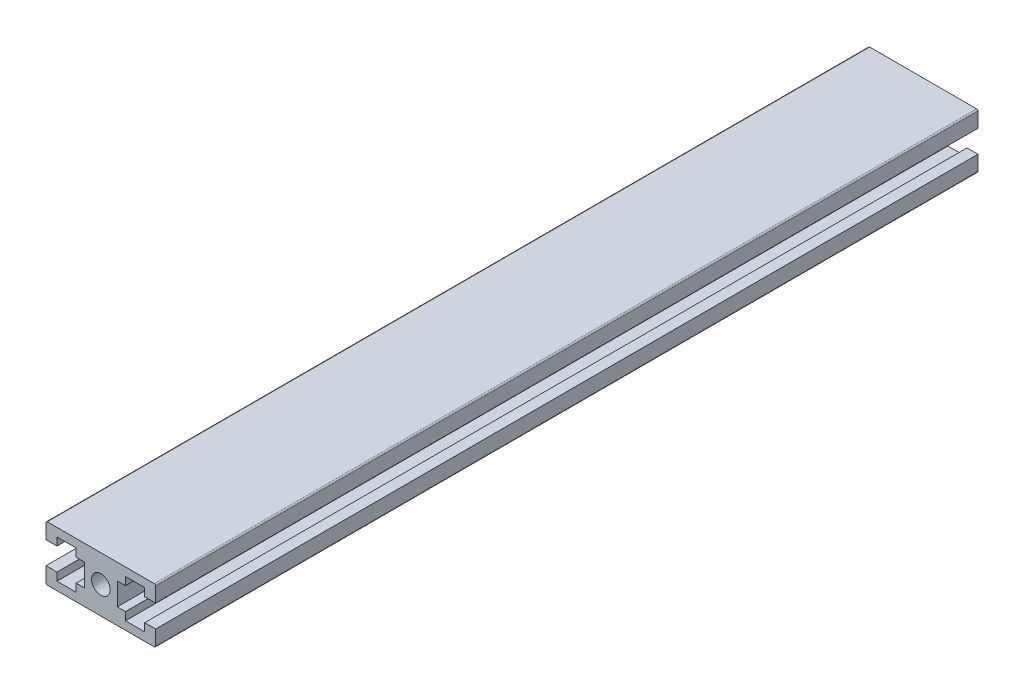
ISO-10303-21;
HEADER;
FILE_DESCRIPTION(('STEP AP214'),'2;1');
FILE_NAME('part.step','',(''),(''),'','','');
FILE_SCHEMA(('AUTOMOTIVE_DESIGN { 1 0 10303 214 1 1 1 1 }'));
ENDSEC;
DATA;
#1=APPLICATION_CONTEXT('core data for automotive mechanical design processes');
#2=APPLICATION_PROTOCOL_DEFINITION('international standard','automotive_design',2000,#1);
#3=PRODUCT_CONTEXT('',#1,'mechanical');
#4=PRODUCT('Part','Part','',(#3));
#5=PRODUCT_RELATED_PRODUCT_CATEGORY('part','',(#4));
#6=PRODUCT_DEFINITION_FORMATION('','',#4);
#7=PRODUCT_DEFINITION_CONTEXT('part definition',#1,'design');
#8=PRODUCT_DEFINITION('design','',#6,#7);
#9=PRODUCT_DEFINITION_SHAPE('','',#8);
#10=(LENGTH_UNIT() NAMED_UNIT(*) SI_UNIT(.MILLI.,.METRE.));
#11=(NAMED_UNIT(*) PLANE_ANGLE_UNIT() SI_UNIT($,.RADIAN.));
#12=(NAMED_UNIT(*) SI_UNIT($,.STERADIAN.) SOLID_ANGLE_UNIT());
#13=UNCERTAINTY_MEASURE_WITH_UNIT(LENGTH_MEASURE(1.E-05),#10,'distance_accuracy_value','');
#14=(GEOMETRIC_REPRESENTATION_CONTEXT(3) GLOBAL_UNCERTAINTY_ASSIGNED_CONTEXT((#13)) GLOBAL_UNIT_ASSIGNED_CONTEXT((#10,
#11,#12)) REPRESENTATION_CONTEXT('',''));
#15=CARTESIAN_POINT('',(0.,0.,0.));
#16=DIRECTION('',(0.,0.,1.));
#17=DIRECTION('',(1.,0.,0.));
#18=AXIS2_PLACEMENT_3D('',#15,#16,#17);
#19=CARTESIAN_POINT('',(19.5,9.50000000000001,150.));
#20=DIRECTION('',(0.,0.,1.));
#21=DIRECTION('',(1.,0.,0.));
#22=AXIS2_PLACEMENT_3D('',#19,#20,#21);
#23=PLANE('',#22);
#24=DIRECTION('',(-1.,0.,0.));
#25=VECTOR('',#24,1.);
#26=CARTESIAN_POINT('',(16.,-6.99999999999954,150.));
#27=LINE('',#26,#25);
#28=CARTESIAN_POINT('',(16.,-6.99999999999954,150.));
#29=VERTEX_POINT('',#28);
#30=CARTESIAN_POINT('',(9.,-6.99999999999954,150.));
#31=VERTEX_POINT('',#30);
#32=EDGE_CURVE('E381',#29,#31,#27,.T.);
#33=ORIENTED_EDGE('',*,*,#32,.T.);
#34=DIRECTION('',(0.,1.,0.));
#35=VECTOR('',#34,1.);
#36=CARTESIAN_POINT('',(9.,-6.99999999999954,150.));
#37=LINE('',#36,#35);
#38=CARTESIAN_POINT('',(9.,-4.09999999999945,150.));
#39=VERTEX_POINT('',#38);
#40=EDGE_CURVE('E172',#31,#39,#37,.T.);
#41=ORIENTED_EDGE('',*,*,#40,.T.);
#42=DIRECTION('',(-1.,0.,0.));
#43=VECTOR('',#42,1.);
#44=CARTESIAN_POINT('',(9.,-4.09999999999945,150.));
#45=LINE('',#44,#43);
#46=CARTESIAN_POINT('',(6.,-4.09999999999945,150.));
#47=VERTEX_POINT('',#46);
#48=EDGE_CURVE('E498',#39,#47,#45,.T.);
#49=ORIENTED_EDGE('',*,*,#48,.T.);
#50=DIRECTION('',(0.,1.,0.));
#51=VECTOR('',#50,1.);
#52=CARTESIAN_POINT('',(6.,-4.09999999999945,150.));
#53=LINE('',#52,#51);
#54=CARTESIAN_POINT('',(6.,4.10000000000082,150.));
#55=VERTEX_POINT('',#54);
#56=EDGE_CURVE('E518',#47,#55,#53,.T.);
#57=ORIENTED_EDGE('',*,*,#56,.T.);
#58=DIRECTION('',(1.,0.,0.));
#59=VECTOR('',#58,1.);
#60=CARTESIAN_POINT('',(6.,4.10000000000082,150.));
#61=LINE('',#60,#59);
#62=CARTESIAN_POINT('',(9.,4.10000000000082,150.));
#63=VERTEX_POINT('',#62);
#64=EDGE_CURVE('E514',#55,#63,#61,.T.);
#65=ORIENTED_EDGE('',*,*,#64,.T.);
#66=DIRECTION('',(0.,1.,0.));
#67=VECTOR('',#66,1.);
#68=CARTESIAN_POINT('',(9.,4.10000000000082,150.));
#69=LINE('',#68,#67);
#70=CARTESIAN_POINT('',(9.,7.00000000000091,150.));
#71=VERTEX_POINT('',#70);
#72=EDGE_CURVE('E517',#63,#71,#69,.T.);
#73=ORIENTED_EDGE('',*,*,#72,.T.);
#74=DIRECTION('',(1.,0.,0.));
#75=VECTOR('',#74,1.);
#76=CARTESIAN_POINT('',(9.,7.00000000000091,150.));
#77=LINE('',#76,#75);
#78=CARTESIAN_POINT('',(16.,7.00000000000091,150.));
#79=VERTEX_POINT('',#78);
#80=EDGE_CURVE('E522',#71,#79,#77,.T.);
#81=ORIENTED_EDGE('',*,*,#80,.T.);
#82=DIRECTION('',(0.,-1.,0.));
#83=VECTOR('',#82,1.);
#84=CARTESIAN_POINT('',(16.,7.00000000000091,150.));
#85=LINE('',#84,#83);
#86=CARTESIAN_POINT('',(16.,4.10000000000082,150.));
#87=VERTEX_POINT('',#86);
#88=EDGE_CURVE('E530',#79,#87,#85,.T.);
#89=ORIENTED_EDGE('',*,*,#88,.T.);
#90=DIRECTION('',(1.,0.,0.));
#91=VECTOR('',#90,1.);
#92=CARTESIAN_POINT('',(16.,4.10000000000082,150.));
#93=LINE('',#92,#91);
#94=CARTESIAN_POINT('',(20.,4.10000000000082,150.));
#95=VERTEX_POINT('',#94);
#96=EDGE_CURVE('E533',#87,#95,#93,.T.);
#97=ORIENTED_EDGE('',*,*,#96,.T.);
#98=DIRECTION('',(0.,1.,0.));
#99=VECTOR('',#98,1.);
#100=CARTESIAN_POINT('',(20.,4.10000000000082,150.));
#101=LINE('',#100,#99);
#102=CARTESIAN_POINT('',(20.,9.5,150.));
#103=VERTEX_POINT('',#102);
#104=EDGE_CURVE('E536',#95,#103,#101,.T.);
#105=ORIENTED_EDGE('',*,*,#104,.T.);
#106=CARTESIAN_POINT('',(19.5,9.50000000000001,150.));
#107=DIRECTION('',(0.,0.,1.));
#108=DIRECTION('',(1.,0.,0.));
#109=AXIS2_PLACEMENT_3D('',#106,#107,#108);
#110=CIRCLE('',#109,0.499999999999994);
#111=CARTESIAN_POINT('',(19.5,10.,150.));
#112=VERTEX_POINT('',#111);
#113=EDGE_CURVE('E539',#103,#112,#110,.T.);
#114=ORIENTED_EDGE('',*,*,#113,.T.);
#115=DIRECTION('',(-1.,0.,0.));
#116=VECTOR('',#115,1.);
#117=CARTESIAN_POINT('',(19.5,10.,150.));
#118=LINE('',#117,#116);
#119=CARTESIAN_POINT('',(-19.5,10.,150.));
#120=VERTEX_POINT('',#119);
#121=EDGE_CURVE('E542',#112,#120,#118,.T.);
#122=ORIENTED_EDGE('',*,*,#121,.T.);
#123=CARTESIAN_POINT('',(-19.5,9.5,150.));
#124=DIRECTION('',(0.,0.,1.));
#125=DIRECTION('',(1.,0.,0.));
#126=AXIS2_PLACEMENT_3D('',#123,#124,#125);
#127=CIRCLE('',#126,0.5);
#128=CARTESIAN_POINT('',(-20.,9.5,150.));
#129=VERTEX_POINT('',#128);
#130=EDGE_CURVE('E545',#120,#129,#127,.T.);
#131=ORIENTED_EDGE('',*,*,#130,.T.);
#132=DIRECTION('',(0.,-1.,0.));
#133=VECTOR('',#132,1.);
#134=CARTESIAN_POINT('',(-20.,9.5,150.));
#135=LINE('',#134,#133);
#136=CARTESIAN_POINT('',(-20.,4.09999999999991,150.));
#137=VERTEX_POINT('',#136);
#138=EDGE_CURVE('E548',#129,#137,#135,.T.);
#139=ORIENTED_EDGE('',*,*,#138,.T.);
#140=DIRECTION('',(1.,0.,0.));
#141=VECTOR('',#140,1.);
#142=CARTESIAN_POINT('',(-20.,4.09999999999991,150.));
#143=LINE('',#142,#141);
#144=CARTESIAN_POINT('',(-16.,4.09999999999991,150.));
#145=VERTEX_POINT('',#144);
#146=EDGE_CURVE('E551',#137,#145,#143,.T.);
#147=ORIENTED_EDGE('',*,*,#146,.T.);
#148=DIRECTION('',(0.,1.,0.));
#149=VECTOR('',#148,1.);
#150=CARTESIAN_POINT('',(-16.,4.09999999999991,150.));
#151=LINE('',#150,#149);
#152=CARTESIAN_POINT('',(-16.,7.,150.));
#153=VERTEX_POINT('',#152);
#154=EDGE_CURVE('E554',#145,#153,#151,.T.);
#155=ORIENTED_EDGE('',*,*,#154,.T.);
#156=DIRECTION('',(1.,0.,0.));
#157=VECTOR('',#156,1.);
#158=CARTESIAN_POINT('',(-16.,7.,150.));
#159=LINE('',#158,#157);
#160=CARTESIAN_POINT('',(-9.,7.,150.));
#161=VERTEX_POINT('',#160);
#162=EDGE_CURVE('E556',#153,#161,#159,.T.);
#163=ORIENTED_EDGE('',*,*,#162,.T.);
#164=DIRECTION('',(0.,-1.,0.));
#165=VECTOR('',#164,1.);
#166=CARTESIAN_POINT('',(-9.,7.,150.));
#167=LINE('',#166,#165);
#168=CARTESIAN_POINT('',(-9.,4.09999999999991,150.));
#169=VERTEX_POINT('',#168);
#170=EDGE_CURVE('E559',#161,#169,#167,.T.);
#171=ORIENTED_EDGE('',*,*,#170,.T.);
#172=DIRECTION('',(1.,0.,0.));
#173=VECTOR('',#172,1.);
#174=CARTESIAN_POINT('',(-9.,4.09999999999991,150.));
#175=LINE('',#174,#173);
#176=CARTESIAN_POINT('',(-6.,4.09999999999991,150.));
#177=VERTEX_POINT('',#176);
#178=EDGE_CURVE('E562',#169,#177,#175,.T.);
#179=ORIENTED_EDGE('',*,*,#178,.T.);
#180=DIRECTION('',(0.,-1.,0.));
#181=VECTOR('',#180,1.);
#182=CARTESIAN_POINT('',(-6.,4.09999999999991,150.));
#183=LINE('',#182,#181);
#184=CARTESIAN_POINT('',(-6.,-4.10000000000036,150.));
#185=VERTEX_POINT('',#184);
#186=EDGE_CURVE('E565',#177,#185,#183,.T.);
#187=ORIENTED_EDGE('',*,*,#186,.T.);
#188=DIRECTION('',(-1.,0.,0.));
#189=VECTOR('',#188,1.);
#190=CARTESIAN_POINT('',(-6.,-4.10000000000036,150.));
#191=LINE('',#190,#189);
#192=CARTESIAN_POINT('',(-9.,-4.10000000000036,150.));
#193=VERTEX_POINT('',#192);
#194=EDGE_CURVE('E568',#185,#193,#191,.T.);
#195=ORIENTED_EDGE('',*,*,#194,.T.);
#196=DIRECTION('',(0.,-1.,0.));
#197=VECTOR('',#196,1.);
#198=CARTESIAN_POINT('',(-9.,-4.10000000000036,150.));
#199=LINE('',#198,#197);
#200=CARTESIAN_POINT('',(-9.,-7.,150.));
#201=VERTEX_POINT('',#200);
#202=EDGE_CURVE('E571',#193,#201,#199,.T.);
#203=ORIENTED_EDGE('',*,*,#202,.T.);
#204=DIRECTION('',(-1.,0.,0.));
#205=VECTOR('',#204,1.);
#206=CARTESIAN_POINT('',(-9.,-7.,150.));
#207=LINE('',#206,#205);
#208=CARTESIAN_POINT('',(-16.,-7.,150.));
#209=VERTEX_POINT('',#208);
#210=EDGE_CURVE('E574',#201,#209,#207,.T.);
#211=ORIENTED_EDGE('',*,*,#210,.T.);
#212=DIRECTION('',(0.,1.,0.));
#213=VECTOR('',#212,1.);
#214=CARTESIAN_POINT('',(-16.,-7.,150.));
#215=LINE('',#214,#213);
#216=CARTESIAN_POINT('',(-16.,-4.10000000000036,150.));
#217=VERTEX_POINT('',#216);
#218=EDGE_CURVE('E577',#209,#217,#215,.T.);
#219=ORIENTED_EDGE('',*,*,#218,.T.);
#220=DIRECTION('',(-1.,0.,0.));
#221=VECTOR('',#220,1.);
#222=CARTESIAN_POINT('',(-16.,-4.10000000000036,150.));
#223=LINE('',#222,#221);
#224=CARTESIAN_POINT('',(-20.,-4.10000000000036,150.));
#225=VERTEX_POINT('',#224);
#226=EDGE_CURVE('E580',#217,#225,#223,.T.);
#227=ORIENTED_EDGE('',*,*,#226,.T.);
#228=DIRECTION('',(0.,-1.,0.));
#229=VECTOR('',#228,1.);
#230=CARTESIAN_POINT('',(-20.,-4.10000000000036,150.));
#231=LINE('',#230,#229);
#232=CARTESIAN_POINT('',(-20.,-9.5,150.));
#233=VERTEX_POINT('',#232);
#234=EDGE_CURVE('E583',#225,#233,#231,.T.);
#235=ORIENTED_EDGE('',*,*,#234,.T.);
#236=CARTESIAN_POINT('',(-19.5,-9.5,150.));
#237=DIRECTION('',(0.,0.,1.));
#238=DIRECTION('',(1.,0.,0.));
#239=AXIS2_PLACEMENT_3D('',#236,#237,#238);
#240=CIRCLE('',#239,0.5);
#241=CARTESIAN_POINT('',(-19.5,-10.,150.));
#242=VERTEX_POINT('',#241);
#243=EDGE_CURVE('E586',#233,#242,#240,.T.);
#244=ORIENTED_EDGE('',*,*,#243,.T.);
#245=DIRECTION('',(1.,0.,0.));
#246=VECTOR('',#245,1.);
#247=CARTESIAN_POINT('',(-19.5,-10.,150.));
#248=LINE('',#247,#246);
#249=CARTESIAN_POINT('',(19.5,-10.,150.));
#250=VERTEX_POINT('',#249);
#251=EDGE_CURVE('E588',#242,#250,#248,.T.);
#252=ORIENTED_EDGE('',*,*,#251,.T.);
#253=CARTESIAN_POINT('',(19.5,-9.50000000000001,150.));
#254=DIRECTION('',(0.,0.,1.));
#255=DIRECTION('',(1.,0.,0.));
#256=AXIS2_PLACEMENT_3D('',#253,#254,#255);
#257=CIRCLE('',#256,0.499999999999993);
#258=CARTESIAN_POINT('',(20.,-9.5,150.));
#259=VERTEX_POINT('',#258);
#260=EDGE_CURVE('E263',#250,#259,#257,.T.);
#261=ORIENTED_EDGE('',*,*,#260,.T.);
#262=DIRECTION('',(0.,1.,0.));
#263=VECTOR('',#262,1.);
#264=CARTESIAN_POINT('',(20.,-9.5,150.));
#265=LINE('',#264,#263);
#266=CARTESIAN_POINT('',(20.,-4.09999999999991,150.));
#267=VERTEX_POINT('',#266);
#268=EDGE_CURVE('E257',#259,#267,#265,.T.);
#269=ORIENTED_EDGE('',*,*,#268,.T.);
#270=DIRECTION('',(-1.,0.,0.));
#271=VECTOR('',#270,1.);
#272=CARTESIAN_POINT('',(20.,-4.09999999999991,150.));
#273=LINE('',#272,#271);
#274=CARTESIAN_POINT('',(16.,-4.09999999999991,150.));
#275=VERTEX_POINT('',#274);
#276=EDGE_CURVE('E261',#267,#275,#273,.T.);
#277=ORIENTED_EDGE('',*,*,#276,.T.);
#278=DIRECTION('',(0.,-1.,0.));
#279=VECTOR('',#278,1.);
#280=CARTESIAN_POINT('',(16.,-4.09999999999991,150.));
#281=LINE('',#280,#279);
#282=EDGE_CURVE('E57',#275,#29,#281,.T.);
#283=ORIENTED_EDGE('',*,*,#282,.T.);
#284=EDGE_LOOP('',(#33,#41,#49,#57,#65,#73,#81,#89,#97,#105,#114,#122,#131,#139,#147,#155,#163,
#171,#179,#187,#195,#203,#211,#219,#227,#235,#244,#252,#261,#269,#277,#283));
#285=FACE_BOUND('',#284,.T.);
#286=CARTESIAN_POINT('',(0.,0.,150.));
#287=DIRECTION('',(0.,0.,1.));
#288=DIRECTION('',(1.,0.,0.));
#289=AXIS2_PLACEMENT_3D('',#286,#287,#288);
#290=CIRCLE('',#289,3.4);
#291=CARTESIAN_POINT('',(3.4,0.,150.));
#292=VERTEX_POINT('',#291);
#293=EDGE_CURVE('E292',#292,#292,#290,.T.);
#294=ORIENTED_EDGE('',*,*,#293,.F.);
#295=EDGE_LOOP('',(#294));
#296=FACE_BOUND('',#295,.T.);
#297=ADVANCED_FACE('F39',(#285,#296),#23,.T.);
#298=CARTESIAN_POINT('',(19.5,9.50000000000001,-150.));
#299=DIRECTION('',(0.,0.,1.));
#300=DIRECTION('',(1.,0.,0.));
#301=AXIS2_PLACEMENT_3D('',#298,#299,#300);
#302=PLANE('',#301);
#303=DIRECTION('',(-1.,0.,0.));
#304=VECTOR('',#303,1.);
#305=CARTESIAN_POINT('',(16.,-6.99999999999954,-150.));
#306=LINE('',#305,#304);
#307=CARTESIAN_POINT('',(16.,-6.99999999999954,-150.));
#308=VERTEX_POINT('',#307);
#309=CARTESIAN_POINT('',(9.,-6.99999999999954,-150.));
#310=VERTEX_POINT('',#309);
#311=EDGE_CURVE('E287',#308,#310,#306,.T.);
#312=ORIENTED_EDGE('',*,*,#311,.F.);
#313=DIRECTION('',(0.,-1.,0.));
#314=VECTOR('',#313,1.);
#315=CARTESIAN_POINT('',(16.,-4.09999999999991,-150.));
#316=LINE('',#315,#314);
#317=CARTESIAN_POINT('',(16.,-4.09999999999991,-150.));
#318=VERTEX_POINT('',#317);
#319=EDGE_CURVE('E164',#318,#308,#316,.T.);
#320=ORIENTED_EDGE('',*,*,#319,.F.);
#321=DIRECTION('',(-1.,0.,0.));
#322=VECTOR('',#321,1.);
#323=CARTESIAN_POINT('',(20.,-4.09999999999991,-150.));
#324=LINE('',#323,#322);
#325=CARTESIAN_POINT('',(20.,-4.09999999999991,-150.));
#326=VERTEX_POINT('',#325);
#327=EDGE_CURVE('E158',#326,#318,#324,.T.);
#328=ORIENTED_EDGE('',*,*,#327,.F.);
#329=DIRECTION('',(0.,1.,0.));
#330=VECTOR('',#329,1.);
#331=CARTESIAN_POINT('',(20.,-9.5,-150.));
#332=LINE('',#331,#330);
#333=CARTESIAN_POINT('',(20.,-9.5,-150.));
#334=VERTEX_POINT('',#333);
#335=EDGE_CURVE('E272',#334,#326,#332,.T.);
#336=ORIENTED_EDGE('',*,*,#335,.F.);
#337=CARTESIAN_POINT('',(19.5,-9.50000000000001,-150.));
#338=DIRECTION('',(0.,0.,1.));
#339=DIRECTION('',(1.,0.,0.));
#340=AXIS2_PLACEMENT_3D('',#337,#338,#339);
#341=CIRCLE('',#340,0.499999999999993);
#342=CARTESIAN_POINT('',(19.5,-10.,-150.));
#343=VERTEX_POINT('',#342);
#344=EDGE_CURVE('E372',#343,#334,#341,.T.);
#345=ORIENTED_EDGE('',*,*,#344,.F.);
#346=DIRECTION('',(1.,0.,0.));
#347=VECTOR('',#346,1.);
#348=CARTESIAN_POINT('',(-19.5,-10.,-150.));
#349=LINE('',#348,#347);
#350=CARTESIAN_POINT('',(-19.5,-10.,-150.));
#351=VERTEX_POINT('',#350);
#352=EDGE_CURVE('E369',#351,#343,#349,.T.);
#353=ORIENTED_EDGE('',*,*,#352,.F.);
#354=CARTESIAN_POINT('',(-19.5,-9.5,-150.));
#355=DIRECTION('',(0.,0.,1.));
#356=DIRECTION('',(1.,0.,0.));
#357=AXIS2_PLACEMENT_3D('',#354,#355,#356);
#358=CIRCLE('',#357,0.5);
#359=CARTESIAN_POINT('',(-20.,-9.5,-150.));
#360=VERTEX_POINT('',#359);
#361=EDGE_CURVE('E366',#360,#351,#358,.T.);
#362=ORIENTED_EDGE('',*,*,#361,.F.);
#363=DIRECTION('',(0.,-1.,0.));
#364=VECTOR('',#363,1.);
#365=CARTESIAN_POINT('',(-20.,-4.10000000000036,-150.));
#366=LINE('',#365,#364);
#367=CARTESIAN_POINT('',(-20.,-4.10000000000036,-150.));
#368=VERTEX_POINT('',#367);
#369=EDGE_CURVE('E363',#368,#360,#366,.T.);
#370=ORIENTED_EDGE('',*,*,#369,.F.);
#371=DIRECTION('',(-1.,0.,0.));
#372=VECTOR('',#371,1.);
#373=CARTESIAN_POINT('',(-16.,-4.10000000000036,-150.));
#374=LINE('',#373,#372);
#375=CARTESIAN_POINT('',(-16.,-4.10000000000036,-150.));
#376=VERTEX_POINT('',#375);
#377=EDGE_CURVE('E360',#376,#368,#374,.T.);
#378=ORIENTED_EDGE('',*,*,#377,.F.);
#379=DIRECTION('',(0.,1.,0.));
#380=VECTOR('',#379,1.);
#381=CARTESIAN_POINT('',(-16.,-7.,-150.));
#382=LINE('',#381,#380);
#383=CARTESIAN_POINT('',(-16.,-7.,-150.));
#384=VERTEX_POINT('',#383);
#385=EDGE_CURVE('E357',#384,#376,#382,.T.);
#386=ORIENTED_EDGE('',*,*,#385,.F.);
#387=DIRECTION('',(-1.,0.,0.));
#388=VECTOR('',#387,1.);
#389=CARTESIAN_POINT('',(-9.,-7.,-150.));
#390=LINE('',#389,#388);
#391=CARTESIAN_POINT('',(-9.,-7.,-150.));
#392=VERTEX_POINT('',#391);
#393=EDGE_CURVE('E354',#392,#384,#390,.T.);
#394=ORIENTED_EDGE('',*,*,#393,.F.);
#395=DIRECTION('',(0.,-1.,0.));
#396=VECTOR('',#395,1.);
#397=CARTESIAN_POINT('',(-9.,-4.10000000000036,-150.));
#398=LINE('',#397,#396);
#399=CARTESIAN_POINT('',(-9.,-4.10000000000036,-150.));
#400=VERTEX_POINT('',#399);
#401=EDGE_CURVE('E351',#400,#392,#398,.T.);
#402=ORIENTED_EDGE('',*,*,#401,.F.);
#403=DIRECTION('',(-1.,0.,0.));
#404=VECTOR('',#403,1.);
#405=CARTESIAN_POINT('',(-6.,-4.10000000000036,-150.));
#406=LINE('',#405,#404);
#407=CARTESIAN_POINT('',(-6.,-4.10000000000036,-150.));
#408=VERTEX_POINT('',#407);
#409=EDGE_CURVE('E348',#408,#400,#406,.T.);
#410=ORIENTED_EDGE('',*,*,#409,.F.);
#411=DIRECTION('',(0.,-1.,0.));
#412=VECTOR('',#411,1.);
#413=CARTESIAN_POINT('',(-6.,4.09999999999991,-150.));
#414=LINE('',#413,#412);
#415=CARTESIAN_POINT('',(-6.,4.09999999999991,-150.));
#416=VERTEX_POINT('',#415);
#417=EDGE_CURVE('E345',#416,#408,#414,.T.);
#418=ORIENTED_EDGE('',*,*,#417,.F.);
#419=DIRECTION('',(1.,0.,0.));
#420=VECTOR('',#419,1.);
#421=CARTESIAN_POINT('',(-9.,4.09999999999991,-150.));
#422=LINE('',#421,#420);
#423=CARTESIAN_POINT('',(-9.,4.09999999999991,-150.));
#424=VERTEX_POINT('',#423);
#425=EDGE_CURVE('E342',#424,#416,#422,.T.);
#426=ORIENTED_EDGE('',*,*,#425,.F.);
#427=DIRECTION('',(0.,-1.,0.));
#428=VECTOR('',#427,1.);
#429=CARTESIAN_POINT('',(-9.,7.,-150.));
#430=LINE('',#429,#428);
#431=CARTESIAN_POINT('',(-9.,7.,-150.));
#432=VERTEX_POINT('',#431);
#433=EDGE_CURVE('E339',#432,#424,#430,.T.);
#434=ORIENTED_EDGE('',*,*,#433,.F.);
#435=DIRECTION('',(1.,0.,0.));
#436=VECTOR('',#435,1.);
#437=CARTESIAN_POINT('',(-16.,7.,-150.));
#438=LINE('',#437,#436);
#439=CARTESIAN_POINT('',(-16.,7.,-150.));
#440=VERTEX_POINT('',#439);
#441=EDGE_CURVE('E336',#440,#432,#438,.T.);
#442=ORIENTED_EDGE('',*,*,#441,.F.);
#443=DIRECTION('',(0.,1.,0.));
#444=VECTOR('',#443,1.);
#445=CARTESIAN_POINT('',(-16.,4.09999999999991,-150.));
#446=LINE('',#445,#444);
#447=CARTESIAN_POINT('',(-16.,4.09999999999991,-150.));
#448=VERTEX_POINT('',#447);
#449=EDGE_CURVE('E333',#448,#440,#446,.T.);
#450=ORIENTED_EDGE('',*,*,#449,.F.);
#451=DIRECTION('',(1.,0.,0.));
#452=VECTOR('',#451,1.);
#453=CARTESIAN_POINT('',(-20.,4.09999999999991,-150.));
#454=LINE('',#453,#452);
#455=CARTESIAN_POINT('',(-20.,4.09999999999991,-150.));
#456=VERTEX_POINT('',#455);
#457=EDGE_CURVE('E330',#456,#448,#454,.T.);
#458=ORIENTED_EDGE('',*,*,#457,.F.);
#459=DIRECTION('',(0.,-1.,0.));
#460=VECTOR('',#459,1.);
#461=CARTESIAN_POINT('',(-20.,9.5,-150.));
#462=LINE('',#461,#460);
#463=CARTESIAN_POINT('',(-20.,9.5,-150.));
#464=VERTEX_POINT('',#463);
#465=EDGE_CURVE('E327',#464,#456,#462,.T.);
#466=ORIENTED_EDGE('',*,*,#465,.F.);
#467=CARTESIAN_POINT('',(-19.5,9.5,-150.));
#468=DIRECTION('',(0.,0.,1.));
#469=DIRECTION('',(1.,0.,0.));
#470=AXIS2_PLACEMENT_3D('',#467,#468,#469);
#471=CIRCLE('',#470,0.5);
#472=CARTESIAN_POINT('',(-19.5,10.,-150.));
#473=VERTEX_POINT('',#472);
#474=EDGE_CURVE('E324',#473,#464,#471,.T.);
#475=ORIENTED_EDGE('',*,*,#474,.F.);
#476=DIRECTION('',(-1.,0.,0.));
#477=VECTOR('',#476,1.);
#478=CARTESIAN_POINT('',(19.5,10.,-150.));
#479=LINE('',#478,#477);
#480=CARTESIAN_POINT('',(19.5,10.,-150.));
#481=VERTEX_POINT('',#480);
#482=EDGE_CURVE('E321',#481,#473,#479,.T.);
#483=ORIENTED_EDGE('',*,*,#482,.F.);
#484=CARTESIAN_POINT('',(19.5,9.50000000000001,-150.));
#485=DIRECTION('',(0.,0.,1.));
#486=DIRECTION('',(1.,0.,0.));
#487=AXIS2_PLACEMENT_3D('',#484,#485,#486);
#488=CIRCLE('',#487,0.499999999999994);
#489=CARTESIAN_POINT('',(20.,9.5,-150.));
#490=VERTEX_POINT('',#489);
#491=EDGE_CURVE('E318',#490,#481,#488,.T.);
#492=ORIENTED_EDGE('',*,*,#491,.F.);
#493=DIRECTION('',(0.,1.,0.));
#494=VECTOR('',#493,1.);
#495=CARTESIAN_POINT('',(20.,4.10000000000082,-150.));
#496=LINE('',#495,#494);
#497=CARTESIAN_POINT('',(20.,4.10000000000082,-150.));
#498=VERTEX_POINT('',#497);
#499=EDGE_CURVE('E315',#498,#490,#496,.T.);
#500=ORIENTED_EDGE('',*,*,#499,.F.);
#501=DIRECTION('',(1.,0.,0.));
#502=VECTOR('',#501,1.);
#503=CARTESIAN_POINT('',(16.,4.10000000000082,-150.));
#504=LINE('',#503,#502);
#505=CARTESIAN_POINT('',(16.,4.10000000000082,-150.));
#506=VERTEX_POINT('',#505);
#507=EDGE_CURVE('E312',#506,#498,#504,.T.);
#508=ORIENTED_EDGE('',*,*,#507,.F.);
#509=DIRECTION('',(0.,-1.,0.));
#510=VECTOR('',#509,1.);
#511=CARTESIAN_POINT('',(16.,7.00000000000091,-150.));
#512=LINE('',#511,#510);
#513=CARTESIAN_POINT('',(16.,7.00000000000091,-150.));
#514=VERTEX_POINT('',#513);
#515=EDGE_CURVE('E309',#514,#506,#512,.T.);
#516=ORIENTED_EDGE('',*,*,#515,.F.);
#517=DIRECTION('',(1.,0.,0.));
#518=VECTOR('',#517,1.);
#519=CARTESIAN_POINT('',(9.,7.00000000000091,-150.));
#520=LINE('',#519,#518);
#521=CARTESIAN_POINT('',(9.,7.00000000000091,-150.));
#522=VERTEX_POINT('',#521);
#523=EDGE_CURVE('E306',#522,#514,#520,.T.);
#524=ORIENTED_EDGE('',*,*,#523,.F.);
#525=DIRECTION('',(0.,1.,0.));
#526=VECTOR('',#525,1.);
#527=CARTESIAN_POINT('',(9.,4.10000000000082,-150.));
#528=LINE('',#527,#526);
#529=CARTESIAN_POINT('',(9.,4.10000000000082,-150.));
#530=VERTEX_POINT('',#529);
#531=EDGE_CURVE('E304',#530,#522,#528,.T.);
#532=ORIENTED_EDGE('',*,*,#531,.F.);
#533=DIRECTION('',(1.,0.,0.));
#534=VECTOR('',#533,1.);
#535=CARTESIAN_POINT('',(6.,4.10000000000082,-150.));
#536=LINE('',#535,#534);
#537=CARTESIAN_POINT('',(6.,4.10000000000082,-150.));
#538=VERTEX_POINT('',#537);
#539=EDGE_CURVE('E301',#538,#530,#536,.T.);
#540=ORIENTED_EDGE('',*,*,#539,.F.);
#541=DIRECTION('',(0.,1.,0.));
#542=VECTOR('',#541,1.);
#543=CARTESIAN_POINT('',(6.,-4.09999999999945,-150.));
#544=LINE('',#543,#542);
#545=CARTESIAN_POINT('',(6.,-4.09999999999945,-150.));
#546=VERTEX_POINT('',#545);
#547=EDGE_CURVE('E298',#546,#538,#544,.T.);
#548=ORIENTED_EDGE('',*,*,#547,.F.);
#549=DIRECTION('',(-1.,0.,0.));
#550=VECTOR('',#549,1.);
#551=CARTESIAN_POINT('',(9.,-4.09999999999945,-150.));
#552=LINE('',#551,#550);
#553=CARTESIAN_POINT('',(9.,-4.09999999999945,-150.));
#554=VERTEX_POINT('',#553);
#555=EDGE_CURVE('E295',#554,#546,#552,.T.);
#556=ORIENTED_EDGE('',*,*,#555,.F.);
#557=DIRECTION('',(0.,1.,0.));
#558=VECTOR('',#557,1.);
#559=CARTESIAN_POINT('',(9.,-6.99999999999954,-150.));
#560=LINE('',#559,#558);
#561=EDGE_CURVE('E291',#310,#554,#560,.T.);
#562=ORIENTED_EDGE('',*,*,#561,.F.);
#563=EDGE_LOOP('',(#312,#320,#328,#336,#345,#353,#362,#370,#378,#386,#394,#402,#410,#418,#426,
#434,#442,#450,#458,#466,#475,#483,#492,#500,#508,#516,#524,#532,#540,#548,#556,#562));
#564=FACE_BOUND('',#563,.T.);
#565=CARTESIAN_POINT('',(0.,0.,-150.));
#566=DIRECTION('',(0.,0.,1.));
#567=DIRECTION('',(1.,0.,0.));
#568=AXIS2_PLACEMENT_3D('',#565,#566,#567);
#569=CIRCLE('',#568,3.4);
#570=CARTESIAN_POINT('',(3.4,0.,-150.));
#571=VERTEX_POINT('',#570);
#572=EDGE_CURVE('E592',#571,#571,#569,.T.);
#573=ORIENTED_EDGE('',*,*,#572,.T.);
#574=EDGE_LOOP('',(#573));
#575=FACE_BOUND('',#574,.T.);
#576=ADVANCED_FACE('F502',(#564,#575),#302,.F.);
#577=CARTESIAN_POINT('',(16.,-6.99999999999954,150.));
#578=DIRECTION('',(0.,-1.,0.));
#579=DIRECTION('',(0.,0.,-1.));
#580=AXIS2_PLACEMENT_3D('',#577,#578,#579);
#581=PLANE('',#580);
#582=ORIENTED_EDGE('',*,*,#311,.T.);
#583=DIRECTION('',(0.,0.,-1.));
#584=VECTOR('',#583,1.);
#585=CARTESIAN_POINT('',(9.,-6.99999999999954,150.));
#586=LINE('',#585,#584);
#587=EDGE_CURVE('E11',#31,#310,#586,.T.);
#588=ORIENTED_EDGE('',*,*,#587,.F.);
#589=ORIENTED_EDGE('',*,*,#32,.F.);
#590=DIRECTION('',(0.,0.,-1.));
#591=VECTOR('',#590,1.);
#592=CARTESIAN_POINT('',(16.,-6.99999999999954,150.));
#593=LINE('',#592,#591);
#594=EDGE_CURVE('E283',#29,#308,#593,.T.);
#595=ORIENTED_EDGE('',*,*,#594,.T.);
#596=EDGE_LOOP('',(#582,#588,#589,#595));
#597=FACE_BOUND('',#596,.T.);
#598=ADVANCED_FACE('F41',(#597),#581,.F.);
#599=CARTESIAN_POINT('',(9.,-6.99999999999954,150.));
#600=DIRECTION('',(-1.,0.,0.));
#601=DIRECTION('',(0.,0.,1.));
#602=AXIS2_PLACEMENT_3D('',#599,#600,#601);
#603=PLANE('',#602);
#604=ORIENTED_EDGE('',*,*,#561,.T.);
#605=DIRECTION('',(0.,0.,-1.));
#606=VECTOR('',#605,1.);
#607=CARTESIAN_POINT('',(9.,-4.09999999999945,150.));
#608=LINE('',#607,#606);
#609=EDGE_CURVE('E49',#39,#554,#608,.T.);
#610=ORIENTED_EDGE('',*,*,#609,.F.);
#611=ORIENTED_EDGE('',*,*,#40,.F.);
#612=ORIENTED_EDGE('',*,*,#587,.T.);
#613=EDGE_LOOP('',(#604,#610,#611,#612));
#614=FACE_BOUND('',#613,.T.);
#615=ADVANCED_FACE('F607',(#614),#603,.F.);
#616=CARTESIAN_POINT('',(9.,-4.09999999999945,150.));
#617=DIRECTION('',(0.,-1.,0.));
#618=DIRECTION('',(0.,0.,-1.));
#619=AXIS2_PLACEMENT_3D('',#616,#617,#618);
#620=PLANE('',#619);
#621=ORIENTED_EDGE('',*,*,#555,.T.);
#622=DIRECTION('',(0.,0.,-1.));
#623=VECTOR('',#622,1.);
#624=CARTESIAN_POINT('',(6.,-4.09999999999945,150.));
#625=LINE('',#624,#623);
#626=EDGE_CURVE('E488',#47,#546,#625,.T.);
#627=ORIENTED_EDGE('',*,*,#626,.F.);
#628=ORIENTED_EDGE('',*,*,#48,.F.);
#629=ORIENTED_EDGE('',*,*,#609,.T.);
#630=EDGE_LOOP('',(#621,#627,#628,#629));
#631=FACE_BOUND('',#630,.T.);
#632=ADVANCED_FACE('F496',(#631),#620,.F.);
#633=CARTESIAN_POINT('',(6.,-4.09999999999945,150.));
#634=DIRECTION('',(-1.,0.,0.));
#635=DIRECTION('',(0.,0.,1.));
#636=AXIS2_PLACEMENT_3D('',#633,#634,#635);
#637=PLANE('',#636);
#638=ORIENTED_EDGE('',*,*,#547,.T.);
#639=DIRECTION('',(0.,0.,-1.));
#640=VECTOR('',#639,1.);
#641=CARTESIAN_POINT('',(6.,4.10000000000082,150.));
#642=LINE('',#641,#640);
#643=EDGE_CURVE('E484',#55,#538,#642,.T.);
#644=ORIENTED_EDGE('',*,*,#643,.F.);
#645=ORIENTED_EDGE('',*,*,#56,.F.);
#646=ORIENTED_EDGE('',*,*,#626,.T.);
#647=EDGE_LOOP('',(#638,#644,#645,#646));
#648=FACE_BOUND('',#647,.T.);
#649=ADVANCED_FACE('F508',(#648),#637,.F.);
#650=CARTESIAN_POINT('',(6.,4.10000000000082,150.));
#651=DIRECTION('',(0.,1.,0.));
#652=DIRECTION('',(0.,0.,1.));
#653=AXIS2_PLACEMENT_3D('',#650,#651,#652);
#654=PLANE('',#653);
#655=ORIENTED_EDGE('',*,*,#539,.T.);
#656=DIRECTION('',(0.,0.,-1.));
#657=VECTOR('',#656,1.);
#658=CARTESIAN_POINT('',(9.,4.10000000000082,150.));
#659=LINE('',#658,#657);
#660=EDGE_CURVE('E480',#63,#530,#659,.T.);
#661=ORIENTED_EDGE('',*,*,#660,.F.);
#662=ORIENTED_EDGE('',*,*,#64,.F.);
#663=ORIENTED_EDGE('',*,*,#643,.T.);
#664=EDGE_LOOP('',(#655,#661,#662,#663));
#665=FACE_BOUND('',#664,.T.);
#666=ADVANCED_FACE('F512',(#665),#654,.F.);
#667=CARTESIAN_POINT('',(9.,4.10000000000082,150.));
#668=DIRECTION('',(-1.,0.,0.));
#669=DIRECTION('',(0.,0.,1.));
#670=AXIS2_PLACEMENT_3D('',#667,#668,#669);
#671=PLANE('',#670);
#672=ORIENTED_EDGE('',*,*,#531,.T.);
#673=DIRECTION('',(0.,0.,-1.));
#674=VECTOR('',#673,1.);
#675=CARTESIAN_POINT('',(9.,7.00000000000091,150.));
#676=LINE('',#675,#674);
#677=EDGE_CURVE('E476',#71,#522,#676,.T.);
#678=ORIENTED_EDGE('',*,*,#677,.F.);
#679=ORIENTED_EDGE('',*,*,#72,.F.);
#680=ORIENTED_EDGE('',*,*,#660,.T.);
#681=EDGE_LOOP('',(#672,#678,#679,#680));
#682=FACE_BOUND('',#681,.T.);
#683=ADVANCED_FACE('F721',(#682),#671,.F.);
#684=CARTESIAN_POINT('',(9.,7.00000000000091,150.));
#685=DIRECTION('',(0.,1.,0.));
#686=DIRECTION('',(0.,0.,1.));
#687=AXIS2_PLACEMENT_3D('',#684,#685,#686);
#688=PLANE('',#687);
#689=ORIENTED_EDGE('',*,*,#523,.T.);
#690=DIRECTION('',(0.,0.,-1.));
#691=VECTOR('',#690,1.);
#692=CARTESIAN_POINT('',(16.,7.00000000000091,150.));
#693=LINE('',#692,#691);
#694=EDGE_CURVE('E472',#79,#514,#693,.T.);
#695=ORIENTED_EDGE('',*,*,#694,.F.);
#696=ORIENTED_EDGE('',*,*,#80,.F.);
#697=ORIENTED_EDGE('',*,*,#677,.T.);
#698=EDGE_LOOP('',(#689,#695,#696,#697));
#699=FACE_BOUND('',#698,.T.);
#700=ADVANCED_FACE('F717',(#699),#688,.F.);
#701=CARTESIAN_POINT('',(16.,7.00000000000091,150.));
#702=DIRECTION('',(1.,0.,0.));
#703=DIRECTION('',(0.,0.,-1.));
#704=AXIS2_PLACEMENT_3D('',#701,#702,#703);
#705=PLANE('',#704);
#706=ORIENTED_EDGE('',*,*,#515,.T.);
#707=DIRECTION('',(0.,0.,-1.));
#708=VECTOR('',#707,1.);
#709=CARTESIAN_POINT('',(16.,4.10000000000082,150.));
#710=LINE('',#709,#708);
#711=EDGE_CURVE('E468',#87,#506,#710,.T.);
#712=ORIENTED_EDGE('',*,*,#711,.F.);
#713=ORIENTED_EDGE('',*,*,#88,.F.);
#714=ORIENTED_EDGE('',*,*,#694,.T.);
#715=EDGE_LOOP('',(#706,#712,#713,#714));
#716=FACE_BOUND('',#715,.T.);
#717=ADVANCED_FACE('F713',(#716),#705,.F.);
#718=CARTESIAN_POINT('',(16.,4.10000000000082,150.));
#719=DIRECTION('',(0.,1.,0.));
#720=DIRECTION('',(0.,0.,1.));
#721=AXIS2_PLACEMENT_3D('',#718,#719,#720);
#722=PLANE('',#721);
#723=ORIENTED_EDGE('',*,*,#507,.T.);
#724=DIRECTION('',(0.,0.,-1.));
#725=VECTOR('',#724,1.);
#726=CARTESIAN_POINT('',(20.,4.10000000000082,150.));
#727=LINE('',#726,#725);
#728=EDGE_CURVE('E464',#95,#498,#727,.T.);
#729=ORIENTED_EDGE('',*,*,#728,.F.);
#730=ORIENTED_EDGE('',*,*,#96,.F.);
#731=ORIENTED_EDGE('',*,*,#711,.T.);
#732=EDGE_LOOP('',(#723,#729,#730,#731));
#733=FACE_BOUND('',#732,.T.);
#734=ADVANCED_FACE('F709',(#733),#722,.F.);
#735=CARTESIAN_POINT('',(20.,4.10000000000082,150.));
#736=DIRECTION('',(-1.,0.,0.));
#737=DIRECTION('',(0.,0.,1.));
#738=AXIS2_PLACEMENT_3D('',#735,#736,#737);
#739=PLANE('',#738);
#740=ORIENTED_EDGE('',*,*,#499,.T.);
#741=DIRECTION('',(0.,0.,-1.));
#742=VECTOR('',#741,1.);
#743=CARTESIAN_POINT('',(20.,9.5,150.));
#744=LINE('',#743,#742);
#745=EDGE_CURVE('E460',#103,#490,#744,.T.);
#746=ORIENTED_EDGE('',*,*,#745,.F.);
#747=ORIENTED_EDGE('',*,*,#104,.F.);
#748=ORIENTED_EDGE('',*,*,#728,.T.);
#749=EDGE_LOOP('',(#740,#746,#747,#748));
#750=FACE_BOUND('',#749,.T.);
#751=ADVANCED_FACE('F705',(#750),#739,.F.);
#752=CARTESIAN_POINT('',(19.5,9.50000000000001,150.));
#753=DIRECTION('',(0.,0.,-1.));
#754=DIRECTION('',(-1.,0.,0.));
#755=AXIS2_PLACEMENT_3D('',#752,#753,#754);
#756=CYLINDRICAL_SURFACE('',#755,0.499999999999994);
#757=ORIENTED_EDGE('',*,*,#491,.T.);
#758=DIRECTION('',(0.,0.,-1.));
#759=VECTOR('',#758,1.);
#760=CARTESIAN_POINT('',(19.5,10.,150.));
#761=LINE('',#760,#759);
#762=EDGE_CURVE('E456',#112,#481,#761,.T.);
#763=ORIENTED_EDGE('',*,*,#762,.F.);
#764=ORIENTED_EDGE('',*,*,#113,.F.);
#765=ORIENTED_EDGE('',*,*,#745,.T.);
#766=EDGE_LOOP('',(#757,#763,#764,#765));
#767=FACE_BOUND('',#766,.T.);
#768=ADVANCED_FACE('F701',(#767),#756,.T.);
#769=CARTESIAN_POINT('',(19.5,10.,150.));
#770=DIRECTION('',(0.,-1.,0.));
#771=DIRECTION('',(0.,0.,-1.));
#772=AXIS2_PLACEMENT_3D('',#769,#770,#771);
#773=PLANE('',#772);
#774=ORIENTED_EDGE('',*,*,#482,.T.);
#775=DIRECTION('',(0.,0.,-1.));
#776=VECTOR('',#775,1.);
#777=CARTESIAN_POINT('',(-19.5,10.,150.));
#778=LINE('',#777,#776);
#779=EDGE_CURVE('E452',#120,#473,#778,.T.);
#780=ORIENTED_EDGE('',*,*,#779,.F.);
#781=ORIENTED_EDGE('',*,*,#121,.F.);
#782=ORIENTED_EDGE('',*,*,#762,.T.);
#783=EDGE_LOOP('',(#774,#780,#781,#782));
#784=FACE_BOUND('',#783,.T.);
#785=ADVANCED_FACE('F697',(#784),#773,.F.);
#786=CARTESIAN_POINT('',(-19.5,9.5,150.));
#787=DIRECTION('',(0.,0.,-1.));
#788=DIRECTION('',(-1.,0.,0.));
#789=AXIS2_PLACEMENT_3D('',#786,#787,#788);
#790=CYLINDRICAL_SURFACE('',#789,0.5);
#791=ORIENTED_EDGE('',*,*,#474,.T.);
#792=DIRECTION('',(0.,0.,-1.));
#793=VECTOR('',#792,1.);
#794=CARTESIAN_POINT('',(-20.,9.5,150.));
#795=LINE('',#794,#793);
#796=EDGE_CURVE('E448',#129,#464,#795,.T.);
#797=ORIENTED_EDGE('',*,*,#796,.F.);
#798=ORIENTED_EDGE('',*,*,#130,.F.);
#799=ORIENTED_EDGE('',*,*,#779,.T.);
#800=EDGE_LOOP('',(#791,#797,#798,#799));
#801=FACE_BOUND('',#800,.T.);
#802=ADVANCED_FACE('F693',(#801),#790,.T.);
#803=CARTESIAN_POINT('',(-20.,9.5,150.));
#804=DIRECTION('',(1.,0.,0.));
#805=DIRECTION('',(0.,1.,0.));
#806=AXIS2_PLACEMENT_3D('',#803,#804,#805);
#807=PLANE('',#806);
#808=ORIENTED_EDGE('',*,*,#465,.T.);
#809=DIRECTION('',(0.,0.,-1.));
#810=VECTOR('',#809,1.);
#811=CARTESIAN_POINT('',(-20.,4.09999999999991,150.));
#812=LINE('',#811,#810);
#813=EDGE_CURVE('E444',#137,#456,#812,.T.);
#814=ORIENTED_EDGE('',*,*,#813,.F.);
#815=ORIENTED_EDGE('',*,*,#138,.F.);
#816=ORIENTED_EDGE('',*,*,#796,.T.);
#817=EDGE_LOOP('',(#808,#814,#815,#816));
#818=FACE_BOUND('',#817,.T.);
#819=ADVANCED_FACE('F689',(#818),#807,.F.);
#820=CARTESIAN_POINT('',(-20.,4.09999999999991,150.));
#821=DIRECTION('',(0.,1.,0.));
#822=DIRECTION('',(0.,0.,1.));
#823=AXIS2_PLACEMENT_3D('',#820,#821,#822);
#824=PLANE('',#823);
#825=ORIENTED_EDGE('',*,*,#457,.T.);
#826=DIRECTION('',(0.,0.,-1.));
#827=VECTOR('',#826,1.);
#828=CARTESIAN_POINT('',(-16.,4.09999999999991,150.));
#829=LINE('',#828,#827);
#830=EDGE_CURVE('E440',#145,#448,#829,.T.);
#831=ORIENTED_EDGE('',*,*,#830,.F.);
#832=ORIENTED_EDGE('',*,*,#146,.F.);
#833=ORIENTED_EDGE('',*,*,#813,.T.);
#834=EDGE_LOOP('',(#825,#831,#832,#833));
#835=FACE_BOUND('',#834,.T.);
#836=ADVANCED_FACE('F685',(#835),#824,.F.);
#837=CARTESIAN_POINT('',(-16.,4.09999999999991,150.));
#838=DIRECTION('',(-1.,0.,0.));
#839=DIRECTION('',(0.,0.,1.));
#840=AXIS2_PLACEMENT_3D('',#837,#838,#839);
#841=PLANE('',#840);
#842=ORIENTED_EDGE('',*,*,#449,.T.);
#843=DIRECTION('',(0.,0.,-1.));
#844=VECTOR('',#843,1.);
#845=CARTESIAN_POINT('',(-16.,7.,150.));
#846=LINE('',#845,#844);
#847=EDGE_CURVE('E436',#153,#440,#846,.T.);
#848=ORIENTED_EDGE('',*,*,#847,.F.);
#849=ORIENTED_EDGE('',*,*,#154,.F.);
#850=ORIENTED_EDGE('',*,*,#830,.T.);
#851=EDGE_LOOP('',(#842,#848,#849,#850));
#852=FACE_BOUND('',#851,.T.);
#853=ADVANCED_FACE('F681',(#852),#841,.F.);
#854=CARTESIAN_POINT('',(-16.,7.,150.));
#855=DIRECTION('',(0.,1.,0.));
#856=DIRECTION('',(0.,0.,1.));
#857=AXIS2_PLACEMENT_3D('',#854,#855,#856);
#858=PLANE('',#857);
#859=ORIENTED_EDGE('',*,*,#441,.T.);
#860=DIRECTION('',(0.,0.,-1.));
#861=VECTOR('',#860,1.);
#862=CARTESIAN_POINT('',(-9.,7.,150.));
#863=LINE('',#862,#861);
#864=EDGE_CURVE('E432',#161,#432,#863,.T.);
#865=ORIENTED_EDGE('',*,*,#864,.F.);
#866=ORIENTED_EDGE('',*,*,#162,.F.);
#867=ORIENTED_EDGE('',*,*,#847,.T.);
#868=EDGE_LOOP('',(#859,#865,#866,#867));
#869=FACE_BOUND('',#868,.T.);
#870=ADVANCED_FACE('F677',(#869),#858,.F.);
#871=CARTESIAN_POINT('',(-9.,7.,150.));
#872=DIRECTION('',(1.,0.,0.));
#873=DIRECTION('',(0.,0.,-1.));
#874=AXIS2_PLACEMENT_3D('',#871,#872,#873);
#875=PLANE('',#874);
#876=ORIENTED_EDGE('',*,*,#433,.T.);
#877=DIRECTION('',(0.,0.,-1.));
#878=VECTOR('',#877,1.);
#879=CARTESIAN_POINT('',(-9.,4.09999999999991,150.));
#880=LINE('',#879,#878);
#881=EDGE_CURVE('E428',#169,#424,#880,.T.);
#882=ORIENTED_EDGE('',*,*,#881,.F.);
#883=ORIENTED_EDGE('',*,*,#170,.F.);
#884=ORIENTED_EDGE('',*,*,#864,.T.);
#885=EDGE_LOOP('',(#876,#882,#883,#884));
#886=FACE_BOUND('',#885,.T.);
#887=ADVANCED_FACE('F673',(#886),#875,.F.);
#888=CARTESIAN_POINT('',(-9.,4.09999999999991,150.));
#889=DIRECTION('',(0.,1.,0.));
#890=DIRECTION('',(0.,0.,1.));
#891=AXIS2_PLACEMENT_3D('',#888,#889,#890);
#892=PLANE('',#891);
#893=ORIENTED_EDGE('',*,*,#425,.T.);
#894=DIRECTION('',(0.,0.,-1.));
#895=VECTOR('',#894,1.);
#896=CARTESIAN_POINT('',(-6.,4.09999999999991,150.));
#897=LINE('',#896,#895);
#898=EDGE_CURVE('E424',#177,#416,#897,.T.);
#899=ORIENTED_EDGE('',*,*,#898,.F.);
#900=ORIENTED_EDGE('',*,*,#178,.F.);
#901=ORIENTED_EDGE('',*,*,#881,.T.);
#902=EDGE_LOOP('',(#893,#899,#900,#901));
#903=FACE_BOUND('',#902,.T.);
#904=ADVANCED_FACE('F669',(#903),#892,.F.);
#905=CARTESIAN_POINT('',(-6.,4.09999999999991,150.));
#906=DIRECTION('',(1.,0.,0.));
#907=DIRECTION('',(0.,0.,-1.));
#908=AXIS2_PLACEMENT_3D('',#905,#906,#907);
#909=PLANE('',#908);
#910=ORIENTED_EDGE('',*,*,#417,.T.);
#911=DIRECTION('',(0.,0.,-1.));
#912=VECTOR('',#911,1.);
#913=CARTESIAN_POINT('',(-6.,-4.10000000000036,150.));
#914=LINE('',#913,#912);
#915=EDGE_CURVE('E420',#185,#408,#914,.T.);
#916=ORIENTED_EDGE('',*,*,#915,.F.);
#917=ORIENTED_EDGE('',*,*,#186,.F.);
#918=ORIENTED_EDGE('',*,*,#898,.T.);
#919=EDGE_LOOP('',(#910,#916,#917,#918));
#920=FACE_BOUND('',#919,.T.);
#921=ADVANCED_FACE('F665',(#920),#909,.F.);
#922=CARTESIAN_POINT('',(-6.,-4.10000000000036,150.));
#923=DIRECTION('',(0.,-1.,0.));
#924=DIRECTION('',(0.,0.,-1.));
#925=AXIS2_PLACEMENT_3D('',#922,#923,#924);
#926=PLANE('',#925);
#927=ORIENTED_EDGE('',*,*,#409,.T.);
#928=DIRECTION('',(0.,0.,-1.));
#929=VECTOR('',#928,1.);
#930=CARTESIAN_POINT('',(-9.,-4.10000000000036,150.));
#931=LINE('',#930,#929);
#932=EDGE_CURVE('E416',#193,#400,#931,.T.);
#933=ORIENTED_EDGE('',*,*,#932,.F.);
#934=ORIENTED_EDGE('',*,*,#194,.F.);
#935=ORIENTED_EDGE('',*,*,#915,.T.);
#936=EDGE_LOOP('',(#927,#933,#934,#935));
#937=FACE_BOUND('',#936,.T.);
#938=ADVANCED_FACE('F661',(#937),#926,.F.);
#939=CARTESIAN_POINT('',(-9.,-4.10000000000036,150.));
#940=DIRECTION('',(1.,0.,0.));
#941=DIRECTION('',(0.,0.,-1.));
#942=AXIS2_PLACEMENT_3D('',#939,#940,#941);
#943=PLANE('',#942);
#944=ORIENTED_EDGE('',*,*,#401,.T.);
#945=DIRECTION('',(0.,0.,-1.));
#946=VECTOR('',#945,1.);
#947=CARTESIAN_POINT('',(-9.,-7.,150.));
#948=LINE('',#947,#946);
#949=EDGE_CURVE('E412',#201,#392,#948,.T.);
#950=ORIENTED_EDGE('',*,*,#949,.F.);
#951=ORIENTED_EDGE('',*,*,#202,.F.);
#952=ORIENTED_EDGE('',*,*,#932,.T.);
#953=EDGE_LOOP('',(#944,#950,#951,#952));
#954=FACE_BOUND('',#953,.T.);
#955=ADVANCED_FACE('F657',(#954),#943,.F.);
#956=CARTESIAN_POINT('',(-9.,-7.,150.));
#957=DIRECTION('',(0.,-1.,0.));
#958=DIRECTION('',(0.,0.,-1.));
#959=AXIS2_PLACEMENT_3D('',#956,#957,#958);
#960=PLANE('',#959);
#961=ORIENTED_EDGE('',*,*,#393,.T.);
#962=DIRECTION('',(0.,0.,-1.));
#963=VECTOR('',#962,1.);
#964=CARTESIAN_POINT('',(-16.,-7.,150.));
#965=LINE('',#964,#963);
#966=EDGE_CURVE('E408',#209,#384,#965,.T.);
#967=ORIENTED_EDGE('',*,*,#966,.F.);
#968=ORIENTED_EDGE('',*,*,#210,.F.);
#969=ORIENTED_EDGE('',*,*,#949,.T.);
#970=EDGE_LOOP('',(#961,#967,#968,#969));
#971=FACE_BOUND('',#970,.T.);
#972=ADVANCED_FACE('F653',(#971),#960,.F.);
#973=CARTESIAN_POINT('',(-16.,-7.,150.));
#974=DIRECTION('',(-1.,0.,0.));
#975=DIRECTION('',(0.,0.,1.));
#976=AXIS2_PLACEMENT_3D('',#973,#974,#975);
#977=PLANE('',#976);
#978=ORIENTED_EDGE('',*,*,#385,.T.);
#979=DIRECTION('',(0.,0.,-1.));
#980=VECTOR('',#979,1.);
#981=CARTESIAN_POINT('',(-16.,-4.10000000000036,150.));
#982=LINE('',#981,#980);
#983=EDGE_CURVE('E404',#217,#376,#982,.T.);
#984=ORIENTED_EDGE('',*,*,#983,.F.);
#985=ORIENTED_EDGE('',*,*,#218,.F.);
#986=ORIENTED_EDGE('',*,*,#966,.T.);
#987=EDGE_LOOP('',(#978,#984,#985,#986));
#988=FACE_BOUND('',#987,.T.);
#989=ADVANCED_FACE('F649',(#988),#977,.F.);
#990=CARTESIAN_POINT('',(-16.,-4.10000000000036,150.));
#991=DIRECTION('',(0.,-1.,0.));
#992=DIRECTION('',(0.,0.,-1.));
#993=AXIS2_PLACEMENT_3D('',#990,#991,#992);
#994=PLANE('',#993);
#995=ORIENTED_EDGE('',*,*,#377,.T.);
#996=DIRECTION('',(0.,0.,-1.));
#997=VECTOR('',#996,1.);
#998=CARTESIAN_POINT('',(-20.,-4.10000000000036,150.));
#999=LINE('',#998,#997);
#1000=EDGE_CURVE('E400',#225,#368,#999,.T.);
#1001=ORIENTED_EDGE('',*,*,#1000,.F.);
#1002=ORIENTED_EDGE('',*,*,#226,.F.);
#1003=ORIENTED_EDGE('',*,*,#983,.T.);
#1004=EDGE_LOOP('',(#995,#1001,#1002,#1003));
#1005=FACE_BOUND('',#1004,.T.);
#1006=ADVANCED_FACE('F645',(#1005),#994,.F.);
#1007=CARTESIAN_POINT('',(-20.,-4.10000000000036,150.));
#1008=DIRECTION('',(1.,0.,0.));
#1009=DIRECTION('',(0.,0.,-1.));
#1010=AXIS2_PLACEMENT_3D('',#1007,#1008,#1009);
#1011=PLANE('',#1010);
#1012=ORIENTED_EDGE('',*,*,#369,.T.);
#1013=DIRECTION('',(0.,0.,-1.));
#1014=VECTOR('',#1013,1.);
#1015=CARTESIAN_POINT('',(-20.,-9.5,150.));
#1016=LINE('',#1015,#1014);
#1017=EDGE_CURVE('E396',#233,#360,#1016,.T.);
#1018=ORIENTED_EDGE('',*,*,#1017,.F.);
#1019=ORIENTED_EDGE('',*,*,#234,.F.);
#1020=ORIENTED_EDGE('',*,*,#1000,.T.);
#1021=EDGE_LOOP('',(#1012,#1018,#1019,#1020));
#1022=FACE_BOUND('',#1021,.T.);
#1023=ADVANCED_FACE('F641',(#1022),#1011,.F.);
#1024=CARTESIAN_POINT('',(-19.5,-9.5,150.));
#1025=DIRECTION('',(0.,0.,-1.));
#1026=DIRECTION('',(-1.,0.,0.));
#1027=AXIS2_PLACEMENT_3D('',#1024,#1025,#1026);
#1028=CYLINDRICAL_SURFACE('',#1027,0.5);
#1029=ORIENTED_EDGE('',*,*,#361,.T.);
#1030=DIRECTION('',(0.,0.,-1.));
#1031=VECTOR('',#1030,1.);
#1032=CARTESIAN_POINT('',(-19.5,-10.,150.));
#1033=LINE('',#1032,#1031);
#1034=EDGE_CURVE('E392',#242,#351,#1033,.T.);
#1035=ORIENTED_EDGE('',*,*,#1034,.F.);
#1036=ORIENTED_EDGE('',*,*,#243,.F.);
#1037=ORIENTED_EDGE('',*,*,#1017,.T.);
#1038=EDGE_LOOP('',(#1029,#1035,#1036,#1037));
#1039=FACE_BOUND('',#1038,.T.);
#1040=ADVANCED_FACE('F637',(#1039),#1028,.T.);
#1041=CARTESIAN_POINT('',(-19.5,-10.,150.));
#1042=DIRECTION('',(0.,1.,0.));
#1043=DIRECTION('',(0.,0.,1.));
#1044=AXIS2_PLACEMENT_3D('',#1041,#1042,#1043);
#1045=PLANE('',#1044);
#1046=ORIENTED_EDGE('',*,*,#352,.T.);
#1047=DIRECTION('',(0.,0.,-1.));
#1048=VECTOR('',#1047,1.);
#1049=CARTESIAN_POINT('',(19.5,-10.,150.));
#1050=LINE('',#1049,#1048);
#1051=EDGE_CURVE('E388',#250,#343,#1050,.T.);
#1052=ORIENTED_EDGE('',*,*,#1051,.F.);
#1053=ORIENTED_EDGE('',*,*,#251,.F.);
#1054=ORIENTED_EDGE('',*,*,#1034,.T.);
#1055=EDGE_LOOP('',(#1046,#1052,#1053,#1054));
#1056=FACE_BOUND('',#1055,.T.);
#1057=ADVANCED_FACE('F633',(#1056),#1045,.F.);
#1058=CARTESIAN_POINT('',(19.5,-9.50000000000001,150.));
#1059=DIRECTION('',(0.,0.,-1.));
#1060=DIRECTION('',(-1.,0.,0.));
#1061=AXIS2_PLACEMENT_3D('',#1058,#1059,#1060);
#1062=CYLINDRICAL_SURFACE('',#1061,0.499999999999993);
#1063=ORIENTED_EDGE('',*,*,#344,.T.);
#1064=DIRECTION('',(0.,0.,-1.));
#1065=VECTOR('',#1064,1.);
#1066=CARTESIAN_POINT('',(20.,-9.5,150.));
#1067=LINE('',#1066,#1065);
#1068=EDGE_CURVE('E274',#259,#334,#1067,.T.);
#1069=ORIENTED_EDGE('',*,*,#1068,.F.);
#1070=ORIENTED_EDGE('',*,*,#260,.F.);
#1071=ORIENTED_EDGE('',*,*,#1051,.T.);
#1072=EDGE_LOOP('',(#1063,#1069,#1070,#1071));
#1073=FACE_BOUND('',#1072,.T.);
#1074=ADVANCED_FACE('F630',(#1073),#1062,.T.);
#1075=CARTESIAN_POINT('',(20.,-9.5,150.));
#1076=DIRECTION('',(-1.,0.,0.));
#1077=DIRECTION('',(0.,0.,1.));
#1078=AXIS2_PLACEMENT_3D('',#1075,#1076,#1077);
#1079=PLANE('',#1078);
#1080=ORIENTED_EDGE('',*,*,#335,.T.);
#1081=DIRECTION('',(0.,0.,-1.));
#1082=VECTOR('',#1081,1.);
#1083=CARTESIAN_POINT('',(20.,-4.09999999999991,150.));
#1084=LINE('',#1083,#1082);
#1085=EDGE_CURVE('E269',#267,#326,#1084,.T.);
#1086=ORIENTED_EDGE('',*,*,#1085,.F.);
#1087=ORIENTED_EDGE('',*,*,#268,.F.);
#1088=ORIENTED_EDGE('',*,*,#1068,.T.);
#1089=EDGE_LOOP('',(#1080,#1086,#1087,#1088));
#1090=FACE_BOUND('',#1089,.T.);
#1091=ADVANCED_FACE('F270',(#1090),#1079,.F.);
#1092=CARTESIAN_POINT('',(20.,-4.09999999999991,150.));
#1093=DIRECTION('',(0.,-1.,0.));
#1094=DIRECTION('',(0.,0.,-1.));
#1095=AXIS2_PLACEMENT_3D('',#1092,#1093,#1094);
#1096=PLANE('',#1095);
#1097=ORIENTED_EDGE('',*,*,#327,.T.);
#1098=DIRECTION('',(0.,0.,-1.));
#1099=VECTOR('',#1098,1.);
#1100=CARTESIAN_POINT('',(16.,-4.09999999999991,150.));
#1101=LINE('',#1100,#1099);
#1102=EDGE_CURVE('E275',#275,#318,#1101,.T.);
#1103=ORIENTED_EDGE('',*,*,#1102,.F.);
#1104=ORIENTED_EDGE('',*,*,#276,.F.);
#1105=ORIENTED_EDGE('',*,*,#1085,.T.);
#1106=EDGE_LOOP('',(#1097,#1103,#1104,#1105));
#1107=FACE_BOUND('',#1106,.T.);
#1108=ADVANCED_FACE('F277',(#1107),#1096,.F.);
#1109=CARTESIAN_POINT('',(16.,-4.09999999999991,150.));
#1110=DIRECTION('',(1.,0.,0.));
#1111=DIRECTION('',(0.,0.,-1.));
#1112=AXIS2_PLACEMENT_3D('',#1109,#1110,#1111);
#1113=PLANE('',#1112);
#1114=ORIENTED_EDGE('',*,*,#319,.T.);
#1115=ORIENTED_EDGE('',*,*,#594,.F.);
#1116=ORIENTED_EDGE('',*,*,#282,.F.);
#1117=ORIENTED_EDGE('',*,*,#1102,.T.);
#1118=EDGE_LOOP('',(#1114,#1115,#1116,#1117));
#1119=FACE_BOUND('',#1118,.T.);
#1120=ADVANCED_FACE('F623',(#1119),#1113,.F.);
#1121=CARTESIAN_POINT('',(0.,0.,150.));
#1122=DIRECTION('',(0.,0.,-1.));
#1123=DIRECTION('',(-1.,0.,0.));
#1124=AXIS2_PLACEMENT_3D('',#1121,#1122,#1123);
#1125=CYLINDRICAL_SURFACE('',#1124,3.4);
#1126=ORIENTED_EDGE('',*,*,#293,.T.);
#1127=EDGE_LOOP('',(#1126));
#1128=FACE_BOUND('',#1127,.T.);
#1129=ORIENTED_EDGE('',*,*,#572,.F.);
#1130=EDGE_LOOP('',(#1129));
#1131=FACE_BOUND('',#1130,.T.);
#1132=ADVANCED_FACE('F621',(#1128,#1131),#1125,.F.);
#1133=CLOSED_SHELL('',(#297,#576,#598,#615,#632,#649,#666,#683,#700,#717,#734,#751,#768,#785,
#802,#819,#836,#853,#870,#887,#904,#921,#938,#955,#972,#989,#1006,#1023,#1040,#1057,#1074,#1091,
#1108,#1120,#1132));
#1134=MANIFOLD_SOLID_BREP('B2',#1133);
#1135=ADVANCED_BREP_SHAPE_REPRESENTATION('',(#18,#1134),#14);
#1136=SHAPE_DEFINITION_REPRESENTATION(#9,#1135);
ENDSEC;
END-ISO-10303-21;
